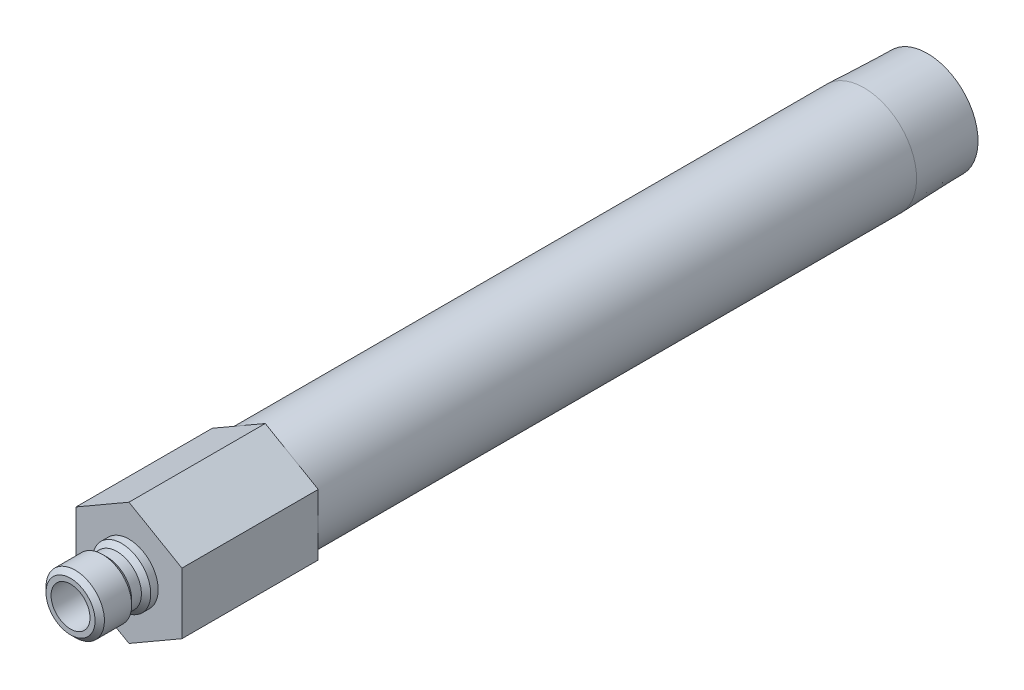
ISO-10303-21;
HEADER;
FILE_DESCRIPTION(('STEP AP214'),'2;1');
FILE_NAME('part.step','',(''),(''),'','','');
FILE_SCHEMA(('AUTOMOTIVE_DESIGN { 1 0 10303 214 1 1 1 1 }'));
ENDSEC;
DATA;
#1=APPLICATION_CONTEXT('core data for automotive mechanical design processes');
#2=APPLICATION_PROTOCOL_DEFINITION('international standard','automotive_design',2000,#1);
#3=PRODUCT_CONTEXT('',#1,'mechanical');
#4=PRODUCT('Part','Part','',(#3));
#5=PRODUCT_RELATED_PRODUCT_CATEGORY('part','',(#4));
#6=PRODUCT_DEFINITION_FORMATION('','',#4);
#7=PRODUCT_DEFINITION_CONTEXT('part definition',#1,'design');
#8=PRODUCT_DEFINITION('design','',#6,#7);
#9=PRODUCT_DEFINITION_SHAPE('','',#8);
#10=(LENGTH_UNIT() NAMED_UNIT(*) SI_UNIT(.MILLI.,.METRE.));
#11=(NAMED_UNIT(*) PLANE_ANGLE_UNIT() SI_UNIT($,.RADIAN.));
#12=(NAMED_UNIT(*) SI_UNIT($,.STERADIAN.) SOLID_ANGLE_UNIT());
#13=UNCERTAINTY_MEASURE_WITH_UNIT(LENGTH_MEASURE(1.E-05),#10,'distance_accuracy_value','');
#14=(GEOMETRIC_REPRESENTATION_CONTEXT(3) GLOBAL_UNCERTAINTY_ASSIGNED_CONTEXT((#13)) GLOBAL_UNIT_ASSIGNED_CONTEXT((#10,
#11,#12)) REPRESENTATION_CONTEXT('',''));
#15=CARTESIAN_POINT('',(0.,0.,0.));
#16=DIRECTION('',(0.,0.,1.));
#17=DIRECTION('',(1.,0.,0.));
#18=AXIS2_PLACEMENT_3D('',#15,#16,#17);
#19=CARTESIAN_POINT('',(0.,0.,0.));
#20=DIRECTION('',(0.,0.,-1.));
#21=DIRECTION('',(0.,1.,0.));
#22=AXIS2_PLACEMENT_3D('',#19,#20,#21);
#23=CYLINDRICAL_SURFACE('',#22,8.57249999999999);
#24=CARTESIAN_POINT('',(0.,0.,-119.8372));
#25=DIRECTION('',(0.,0.,-1.));
#26=DIRECTION('',(0.,1.,0.));
#27=AXIS2_PLACEMENT_3D('',#24,#25,#26);
#28=CIRCLE('',#27,8.57249999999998);
#29=CARTESIAN_POINT('',(0.,8.5725,-119.8372));
#30=VERTEX_POINT('',#29);
#31=EDGE_CURVE('E168',#30,#30,#28,.T.);
#32=ORIENTED_EDGE('',*,*,#31,.F.);
#33=EDGE_LOOP('',(#32));
#34=FACE_BOUND('',#33,.T.);
#35=CARTESIAN_POINT('',(0.,0.,-22.225));
#36=DIRECTION('',(0.,0.,1.));
#37=DIRECTION('',(1.,0.,0.));
#38=AXIS2_PLACEMENT_3D('',#35,#36,#37);
#39=CIRCLE('',#38,8.57249999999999);
#40=CARTESIAN_POINT('',(8.57249999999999,0.,-22.225));
#41=VERTEX_POINT('',#40);
#42=EDGE_CURVE('E37',#41,#41,#39,.F.);
#43=ORIENTED_EDGE('',*,*,#42,.T.);
#44=EDGE_LOOP('',(#43));
#45=FACE_BOUND('',#44,.T.);
#46=ADVANCED_FACE('F33',(#34,#45),#23,.T.);
#47=CARTESIAN_POINT('',(0.,0.,0.));
#48=DIRECTION('',(0.,0.,-1.));
#49=DIRECTION('',(0.,1.,0.));
#50=AXIS2_PLACEMENT_3D('',#47,#48,#49);
#51=CYLINDRICAL_SURFACE('',#50,3.175);
#52=CARTESIAN_POINT('',(0.,0.,9.525));
#53=DIRECTION('',(0.,0.,-1.));
#54=DIRECTION('',(0.,1.,0.));
#55=AXIS2_PLACEMENT_3D('',#52,#53,#54);
#56=CIRCLE('',#55,3.175);
#57=CARTESIAN_POINT('',(0.,3.175,9.525));
#58=VERTEX_POINT('',#57);
#59=EDGE_CURVE('E144',#58,#58,#56,.T.);
#60=ORIENTED_EDGE('',*,*,#59,.F.);
#61=EDGE_LOOP('',(#60));
#62=FACE_BOUND('',#61,.T.);
#63=CARTESIAN_POINT('',(0.,0.,-22.225));
#64=DIRECTION('',(0.,0.,-1.));
#65=DIRECTION('',(0.,1.,0.));
#66=AXIS2_PLACEMENT_3D('',#63,#64,#65);
#67=CIRCLE('',#66,3.17499999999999);
#68=CARTESIAN_POINT('',(0.,3.175,-22.225));
#69=VERTEX_POINT('',#68);
#70=EDGE_CURVE('E11',#69,#69,#67,.T.);
#71=ORIENTED_EDGE('',*,*,#70,.T.);
#72=EDGE_LOOP('',(#71));
#73=FACE_BOUND('',#72,.T.);
#74=ADVANCED_FACE('F35',(#62,#73),#51,.F.);
#75=CARTESIAN_POINT('',(0.,3.175,-22.225));
#76=DIRECTION('',(0.,0.,-1.));
#77=DIRECTION('',(0.,1.,0.));
#78=AXIS2_PLACEMENT_3D('',#75,#76,#77);
#79=PLANE('',#78);
#80=CARTESIAN_POINT('',(0.,0.,-22.225));
#81=DIRECTION('',(0.,0.,-1.));
#82=DIRECTION('',(0.,1.,0.));
#83=AXIS2_PLACEMENT_3D('',#80,#81,#82);
#84=CIRCLE('',#83,6.2611);
#85=CARTESIAN_POINT('',(0.,6.2611,-22.225));
#86=VERTEX_POINT('',#85);
#87=EDGE_CURVE('E43',#86,#86,#84,.T.);
#88=ORIENTED_EDGE('',*,*,#87,.T.);
#89=EDGE_LOOP('',(#88));
#90=FACE_BOUND('',#89,.T.);
#91=ORIENTED_EDGE('',*,*,#70,.F.);
#92=EDGE_LOOP('',(#91));
#93=FACE_BOUND('',#92,.T.);
#94=ADVANCED_FACE('F180',(#90,#93),#79,.T.);
#95=CARTESIAN_POINT('',(0.,0.,0.));
#96=DIRECTION('',(0.,0.,-1.));
#97=DIRECTION('',(0.,1.,0.));
#98=AXIS2_PLACEMENT_3D('',#95,#96,#97);
#99=CYLINDRICAL_SURFACE('',#98,6.26109999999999);
#100=CARTESIAN_POINT('',(0.,0.,-130.175));
#101=DIRECTION('',(0.,0.,-1.));
#102=DIRECTION('',(0.,1.,0.));
#103=AXIS2_PLACEMENT_3D('',#100,#101,#102);
#104=CIRCLE('',#103,6.26109999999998);
#105=CARTESIAN_POINT('',(0.,6.2611,-130.175));
#106=VERTEX_POINT('',#105);
#107=EDGE_CURVE('E174',#106,#106,#104,.T.);
#108=ORIENTED_EDGE('',*,*,#107,.T.);
#109=EDGE_LOOP('',(#108));
#110=FACE_BOUND('',#109,.T.);
#111=ORIENTED_EDGE('',*,*,#87,.F.);
#112=EDGE_LOOP('',(#111));
#113=FACE_BOUND('',#112,.T.);
#114=ADVANCED_FACE('F183',(#110,#113),#99,.F.);
#115=CARTESIAN_POINT('',(0.,8.24944566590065,-130.175));
#116=DIRECTION('',(0.,0.,-1.));
#117=DIRECTION('',(0.,1.,0.));
#118=AXIS2_PLACEMENT_3D('',#115,#116,#117);
#119=PLANE('',#118);
#120=CARTESIAN_POINT('',(0.,0.,-130.175));
#121=DIRECTION('',(0.,0.,-1.));
#122=DIRECTION('',(0.,1.,0.));
#123=AXIS2_PLACEMENT_3D('',#120,#121,#122);
#124=CIRCLE('',#123,8.24944566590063);
#125=CARTESIAN_POINT('',(0.,8.24944566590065,-130.175));
#126=VERTEX_POINT('',#125);
#127=EDGE_CURVE('E171',#126,#126,#124,.T.);
#128=ORIENTED_EDGE('',*,*,#127,.T.);
#129=EDGE_LOOP('',(#128));
#130=FACE_BOUND('',#129,.T.);
#131=ORIENTED_EDGE('',*,*,#107,.F.);
#132=EDGE_LOOP('',(#131));
#133=FACE_BOUND('',#132,.T.);
#134=ADVANCED_FACE('F185',(#130,#133),#119,.T.);
#135=CARTESIAN_POINT('',(0.,0.,-130.175));
#136=DIRECTION('',(0.,0.,1.));
#137=DIRECTION('',(0.,-1.,0.));
#138=AXIS2_PLACEMENT_3D('',#135,#136,#137);
#139=CONICAL_SURFACE('',#138,8.24944566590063,0.0312396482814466);
#140=ORIENTED_EDGE('',*,*,#31,.T.);
#141=EDGE_LOOP('',(#140));
#142=FACE_BOUND('',#141,.T.);
#143=ORIENTED_EDGE('',*,*,#127,.F.);
#144=EDGE_LOOP('',(#143));
#145=FACE_BOUND('',#144,.T.);
#146=ADVANCED_FACE('F192',(#142,#145),#139,.T.);
#147=CARTESIAN_POINT('',(0.,4.7625,0.));
#148=DIRECTION('',(0.,0.,1.));
#149=DIRECTION('',(0.,-1.,0.));
#150=AXIS2_PLACEMENT_3D('',#147,#148,#149);
#151=PLANE('',#150);
#152=CARTESIAN_POINT('',(0.,0.,0.));
#153=DIRECTION('',(0.,0.,-1.));
#154=DIRECTION('',(0.,1.,0.));
#155=AXIS2_PLACEMENT_3D('',#152,#153,#154);
#156=CIRCLE('',#155,4.7625);
#157=CARTESIAN_POINT('',(0.,4.7625,0.));
#158=VERTEX_POINT('',#157);
#159=EDGE_CURVE('E165',#158,#158,#156,.T.);
#160=ORIENTED_EDGE('',*,*,#159,.T.);
#161=EDGE_LOOP('',(#160));
#162=FACE_BOUND('',#161,.T.);
#163=DIRECTION('',(-0.866025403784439,-0.5,0.));
#164=VECTOR('',#163,1.);
#165=CARTESIAN_POINT('',(0.,9.97199384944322,0.));
#166=LINE('',#165,#164);
#167=CARTESIAN_POINT('',(0.,9.97199384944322,0.));
#168=VERTEX_POINT('',#167);
#169=CARTESIAN_POINT('',(-8.636,4.98599692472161,0.));
#170=VERTEX_POINT('',#169);
#171=EDGE_CURVE('E122',#168,#170,#166,.T.);
#172=ORIENTED_EDGE('',*,*,#171,.T.);
#173=DIRECTION('',(0.,-1.,0.));
#174=VECTOR('',#173,1.);
#175=CARTESIAN_POINT('',(-8.636,4.98599692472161,0.));
#176=LINE('',#175,#174);
#177=CARTESIAN_POINT('',(-8.636,-4.98599692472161,0.));
#178=VERTEX_POINT('',#177);
#179=EDGE_CURVE('E125',#170,#178,#176,.T.);
#180=ORIENTED_EDGE('',*,*,#179,.T.);
#181=DIRECTION('',(0.866025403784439,-0.5,0.));
#182=VECTOR('',#181,1.);
#183=CARTESIAN_POINT('',(-8.636,-4.98599692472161,0.));
#184=LINE('',#183,#182);
#185=CARTESIAN_POINT('',(0.,-9.97199384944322,0.));
#186=VERTEX_POINT('',#185);
#187=EDGE_CURVE('E128',#178,#186,#184,.T.);
#188=ORIENTED_EDGE('',*,*,#187,.T.);
#189=DIRECTION('',(0.866025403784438,0.5,0.));
#190=VECTOR('',#189,1.);
#191=CARTESIAN_POINT('',(0.,-9.97199384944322,0.));
#192=LINE('',#191,#190);
#193=CARTESIAN_POINT('',(8.636,-4.98599692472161,0.));
#194=VERTEX_POINT('',#193);
#195=EDGE_CURVE('E131',#186,#194,#192,.T.);
#196=ORIENTED_EDGE('',*,*,#195,.T.);
#197=DIRECTION('',(0.,1.,0.));
#198=VECTOR('',#197,1.);
#199=CARTESIAN_POINT('',(8.636,-4.98599692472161,0.));
#200=LINE('',#199,#198);
#201=CARTESIAN_POINT('',(8.636,4.98599692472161,0.));
#202=VERTEX_POINT('',#201);
#203=EDGE_CURVE('E99',#194,#202,#200,.T.);
#204=ORIENTED_EDGE('',*,*,#203,.T.);
#205=DIRECTION('',(-0.866025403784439,0.5,0.));
#206=VECTOR('',#205,1.);
#207=CARTESIAN_POINT('',(8.636,4.98599692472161,0.));
#208=LINE('',#207,#206);
#209=EDGE_CURVE('E134',#202,#168,#208,.T.);
#210=ORIENTED_EDGE('',*,*,#209,.T.);
#211=EDGE_LOOP('',(#172,#180,#188,#196,#204,#210));
#212=FACE_BOUND('',#211,.T.);
#213=ADVANCED_FACE('F206',(#162,#212),#151,.T.);
#214=CARTESIAN_POINT('',(0.,0.,0.));
#215=DIRECTION('',(0.,0.,-1.));
#216=DIRECTION('',(0.,1.,0.));
#217=AXIS2_PLACEMENT_3D('',#214,#215,#216);
#218=CYLINDRICAL_SURFACE('',#217,4.7625);
#219=CARTESIAN_POINT('',(0.,0.,1.2065));
#220=DIRECTION('',(0.,0.,-1.));
#221=DIRECTION('',(0.,1.,0.));
#222=AXIS2_PLACEMENT_3D('',#219,#220,#221);
#223=CIRCLE('',#222,4.7625);
#224=CARTESIAN_POINT('',(0.,4.7625,1.2065));
#225=VERTEX_POINT('',#224);
#226=EDGE_CURVE('E162',#225,#225,#223,.T.);
#227=ORIENTED_EDGE('',*,*,#226,.T.);
#228=EDGE_LOOP('',(#227));
#229=FACE_BOUND('',#228,.T.);
#230=ORIENTED_EDGE('',*,*,#159,.F.);
#231=EDGE_LOOP('',(#230));
#232=FACE_BOUND('',#231,.T.);
#233=ADVANCED_FACE('F213',(#229,#232),#218,.T.);
#234=CARTESIAN_POINT('',(0.,0.,1.2065));
#235=DIRECTION('',(0.,0.,-1.));
#236=DIRECTION('',(0.,1.,0.));
#237=AXIS2_PLACEMENT_3D('',#234,#235,#236);
#238=CONICAL_SURFACE('',#237,4.7625,0.785398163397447);
#239=CARTESIAN_POINT('',(0.,0.,1.9685));
#240=DIRECTION('',(0.,0.,-1.));
#241=DIRECTION('',(0.,1.,0.));
#242=AXIS2_PLACEMENT_3D('',#239,#240,#241);
#243=CIRCLE('',#242,4.0005);
#244=CARTESIAN_POINT('',(0.,4.0005,1.9685));
#245=VERTEX_POINT('',#244);
#246=EDGE_CURVE('E159',#245,#245,#243,.T.);
#247=ORIENTED_EDGE('',*,*,#246,.T.);
#248=EDGE_LOOP('',(#247));
#249=FACE_BOUND('',#248,.T.);
#250=ORIENTED_EDGE('',*,*,#226,.F.);
#251=EDGE_LOOP('',(#250));
#252=FACE_BOUND('',#251,.T.);
#253=ADVANCED_FACE('F222',(#249,#252),#238,.T.);
#254=CARTESIAN_POINT('',(0.,0.,0.));
#255=DIRECTION('',(0.,0.,-1.));
#256=DIRECTION('',(0.,1.,0.));
#257=AXIS2_PLACEMENT_3D('',#254,#255,#256);
#258=CYLINDRICAL_SURFACE('',#257,4.0005);
#259=CARTESIAN_POINT('',(0.,0.,3.556));
#260=DIRECTION('',(0.,0.,-1.));
#261=DIRECTION('',(0.,1.,0.));
#262=AXIS2_PLACEMENT_3D('',#259,#260,#261);
#263=CIRCLE('',#262,4.0005);
#264=CARTESIAN_POINT('',(0.,4.0005,3.556));
#265=VERTEX_POINT('',#264);
#266=EDGE_CURVE('E156',#265,#265,#263,.T.);
#267=ORIENTED_EDGE('',*,*,#266,.T.);
#268=EDGE_LOOP('',(#267));
#269=FACE_BOUND('',#268,.T.);
#270=ORIENTED_EDGE('',*,*,#246,.F.);
#271=EDGE_LOOP('',(#270));
#272=FACE_BOUND('',#271,.T.);
#273=ADVANCED_FACE('F263',(#269,#272),#258,.T.);
#274=CARTESIAN_POINT('',(0.,0.,3.556));
#275=DIRECTION('',(0.,0.,1.));
#276=DIRECTION('',(0.,-1.,0.));
#277=AXIS2_PLACEMENT_3D('',#274,#275,#276);
#278=CONICAL_SURFACE('',#277,4.0005,0.785398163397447);
#279=CARTESIAN_POINT('',(0.,0.,4.318));
#280=DIRECTION('',(0.,0.,-1.));
#281=DIRECTION('',(0.,1.,0.));
#282=AXIS2_PLACEMENT_3D('',#279,#280,#281);
#283=CIRCLE('',#282,4.7625);
#284=CARTESIAN_POINT('',(0.,4.7625,4.318));
#285=VERTEX_POINT('',#284);
#286=EDGE_CURVE('E153',#285,#285,#283,.T.);
#287=ORIENTED_EDGE('',*,*,#286,.T.);
#288=EDGE_LOOP('',(#287));
#289=FACE_BOUND('',#288,.T.);
#290=ORIENTED_EDGE('',*,*,#266,.F.);
#291=EDGE_LOOP('',(#290));
#292=FACE_BOUND('',#291,.T.);
#293=ADVANCED_FACE('F259',(#289,#292),#278,.T.);
#294=CARTESIAN_POINT('',(0.,0.,0.));
#295=DIRECTION('',(0.,0.,-1.));
#296=DIRECTION('',(0.,1.,0.));
#297=AXIS2_PLACEMENT_3D('',#294,#295,#296);
#298=CYLINDRICAL_SURFACE('',#297,4.7625);
#299=CARTESIAN_POINT('',(0.,0.,8.763));
#300=DIRECTION('',(0.,0.,-1.));
#301=DIRECTION('',(0.,1.,0.));
#302=AXIS2_PLACEMENT_3D('',#299,#300,#301);
#303=CIRCLE('',#302,4.7625);
#304=CARTESIAN_POINT('',(0.,4.7625,8.763));
#305=VERTEX_POINT('',#304);
#306=EDGE_CURVE('E150',#305,#305,#303,.T.);
#307=ORIENTED_EDGE('',*,*,#306,.T.);
#308=EDGE_LOOP('',(#307));
#309=FACE_BOUND('',#308,.T.);
#310=ORIENTED_EDGE('',*,*,#286,.F.);
#311=EDGE_LOOP('',(#310));
#312=FACE_BOUND('',#311,.T.);
#313=ADVANCED_FACE('F255',(#309,#312),#298,.T.);
#314=CARTESIAN_POINT('',(0.,0.,8.763));
#315=DIRECTION('',(0.,0.,-1.));
#316=DIRECTION('',(0.,1.,0.));
#317=AXIS2_PLACEMENT_3D('',#314,#315,#316);
#318=CONICAL_SURFACE('',#317,4.7625,0.785398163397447);
#319=CARTESIAN_POINT('',(0.,0.,9.525));
#320=DIRECTION('',(0.,0.,-1.));
#321=DIRECTION('',(0.,1.,0.));
#322=AXIS2_PLACEMENT_3D('',#319,#320,#321);
#323=CIRCLE('',#322,4.0005);
#324=CARTESIAN_POINT('',(0.,4.0005,9.525));
#325=VERTEX_POINT('',#324);
#326=EDGE_CURVE('E147',#325,#325,#323,.T.);
#327=ORIENTED_EDGE('',*,*,#326,.T.);
#328=EDGE_LOOP('',(#327));
#329=FACE_BOUND('',#328,.T.);
#330=ORIENTED_EDGE('',*,*,#306,.F.);
#331=EDGE_LOOP('',(#330));
#332=FACE_BOUND('',#331,.T.);
#333=ADVANCED_FACE('F251',(#329,#332),#318,.T.);
#334=CARTESIAN_POINT('',(0.,3.175,9.525));
#335=DIRECTION('',(0.,0.,1.));
#336=DIRECTION('',(0.,-1.,0.));
#337=AXIS2_PLACEMENT_3D('',#334,#335,#336);
#338=PLANE('',#337);
#339=ORIENTED_EDGE('',*,*,#59,.T.);
#340=EDGE_LOOP('',(#339));
#341=FACE_BOUND('',#340,.T.);
#342=ORIENTED_EDGE('',*,*,#326,.F.);
#343=EDGE_LOOP('',(#342));
#344=FACE_BOUND('',#343,.T.);
#345=ADVANCED_FACE('F239',(#341,#344),#338,.T.);
#346=CARTESIAN_POINT('',(0.,9.97199384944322,-22.225));
#347=DIRECTION('',(-0.5,0.866025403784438,0.));
#348=DIRECTION('',(-0.866025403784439,-0.5,0.));
#349=AXIS2_PLACEMENT_3D('',#346,#347,#348);
#350=PLANE('',#349);
#351=ORIENTED_EDGE('',*,*,#171,.F.);
#352=DIRECTION('',(0.,0.,1.));
#353=VECTOR('',#352,1.);
#354=CARTESIAN_POINT('',(0.,9.97199384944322,-22.225));
#355=LINE('',#354,#353);
#356=CARTESIAN_POINT('',(0.,9.97199384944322,-22.225));
#357=VERTEX_POINT('',#356);
#358=EDGE_CURVE('E51',#357,#168,#355,.T.);
#359=ORIENTED_EDGE('',*,*,#358,.F.);
#360=DIRECTION('',(-0.866025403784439,-0.5,0.));
#361=VECTOR('',#360,1.);
#362=CARTESIAN_POINT('',(0.,9.97199384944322,-22.225));
#363=LINE('',#362,#361);
#364=CARTESIAN_POINT('',(-8.636,4.98599692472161,-22.225));
#365=VERTEX_POINT('',#364);
#366=EDGE_CURVE('E137',#357,#365,#363,.T.);
#367=ORIENTED_EDGE('',*,*,#366,.T.);
#368=DIRECTION('',(0.,0.,1.));
#369=VECTOR('',#368,1.);
#370=CARTESIAN_POINT('',(-8.636,4.98599692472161,-22.225));
#371=LINE('',#370,#369);
#372=EDGE_CURVE('E86',#365,#170,#371,.T.);
#373=ORIENTED_EDGE('',*,*,#372,.T.);
#374=EDGE_LOOP('',(#351,#359,#367,#373));
#375=FACE_BOUND('',#374,.T.);
#376=ADVANCED_FACE('F226',(#375),#350,.T.);
#377=CARTESIAN_POINT('',(8.636,4.98599692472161,-22.225));
#378=DIRECTION('',(0.5,0.866025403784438,0.));
#379=DIRECTION('',(-0.866025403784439,0.5,0.));
#380=AXIS2_PLACEMENT_3D('',#377,#378,#379);
#381=PLANE('',#380);
#382=ORIENTED_EDGE('',*,*,#209,.F.);
#383=DIRECTION('',(0.,0.,1.));
#384=VECTOR('',#383,1.);
#385=CARTESIAN_POINT('',(8.636,4.98599692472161,-22.225));
#386=LINE('',#385,#384);
#387=CARTESIAN_POINT('',(8.636,4.98599692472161,-22.225));
#388=VERTEX_POINT('',#387);
#389=EDGE_CURVE('E74',#388,#202,#386,.T.);
#390=ORIENTED_EDGE('',*,*,#389,.F.);
#391=DIRECTION('',(-0.866025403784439,0.5,0.));
#392=VECTOR('',#391,1.);
#393=CARTESIAN_POINT('',(8.636,4.98599692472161,-22.225));
#394=LINE('',#393,#392);
#395=EDGE_CURVE('E112',#388,#357,#394,.T.);
#396=ORIENTED_EDGE('',*,*,#395,.T.);
#397=ORIENTED_EDGE('',*,*,#358,.T.);
#398=EDGE_LOOP('',(#382,#390,#396,#397));
#399=FACE_BOUND('',#398,.T.);
#400=ADVANCED_FACE('F231',(#399),#381,.T.);
#401=CARTESIAN_POINT('',(8.636,-4.98599692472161,-22.225));
#402=DIRECTION('',(1.,0.,0.));
#403=DIRECTION('',(0.,1.,0.));
#404=AXIS2_PLACEMENT_3D('',#401,#402,#403);
#405=PLANE('',#404);
#406=ORIENTED_EDGE('',*,*,#203,.F.);
#407=DIRECTION('',(0.,0.,1.));
#408=VECTOR('',#407,1.);
#409=CARTESIAN_POINT('',(8.636,-4.98599692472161,-22.225));
#410=LINE('',#409,#408);
#411=CARTESIAN_POINT('',(8.636,-4.98599692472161,-22.225));
#412=VERTEX_POINT('',#411);
#413=EDGE_CURVE('E94',#412,#194,#410,.T.);
#414=ORIENTED_EDGE('',*,*,#413,.F.);
#415=DIRECTION('',(0.,1.,0.));
#416=VECTOR('',#415,1.);
#417=CARTESIAN_POINT('',(8.636,-4.98599692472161,-22.225));
#418=LINE('',#417,#416);
#419=EDGE_CURVE('E97',#412,#388,#418,.T.);
#420=ORIENTED_EDGE('',*,*,#419,.T.);
#421=ORIENTED_EDGE('',*,*,#389,.T.);
#422=EDGE_LOOP('',(#406,#414,#420,#421));
#423=FACE_BOUND('',#422,.T.);
#424=ADVANCED_FACE('F96',(#423),#405,.T.);
#425=CARTESIAN_POINT('',(0.,-9.97199384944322,-22.225));
#426=DIRECTION('',(0.5,-0.866025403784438,0.));
#427=DIRECTION('',(0.866025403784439,0.5,0.));
#428=AXIS2_PLACEMENT_3D('',#425,#426,#427);
#429=PLANE('',#428);
#430=ORIENTED_EDGE('',*,*,#195,.F.);
#431=DIRECTION('',(0.,0.,1.));
#432=VECTOR('',#431,1.);
#433=CARTESIAN_POINT('',(0.,-9.97199384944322,-22.225));
#434=LINE('',#433,#432);
#435=CARTESIAN_POINT('',(0.,-9.97199384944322,-22.225));
#436=VERTEX_POINT('',#435);
#437=EDGE_CURVE('E104',#436,#186,#434,.T.);
#438=ORIENTED_EDGE('',*,*,#437,.F.);
#439=DIRECTION('',(0.866025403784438,0.5,0.));
#440=VECTOR('',#439,1.);
#441=CARTESIAN_POINT('',(0.,-9.97199384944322,-22.225));
#442=LINE('',#441,#440);
#443=EDGE_CURVE('E110',#436,#412,#442,.T.);
#444=ORIENTED_EDGE('',*,*,#443,.T.);
#445=ORIENTED_EDGE('',*,*,#413,.T.);
#446=EDGE_LOOP('',(#430,#438,#444,#445));
#447=FACE_BOUND('',#446,.T.);
#448=ADVANCED_FACE('F114',(#447),#429,.T.);
#449=CARTESIAN_POINT('',(-8.636,-4.98599692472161,-22.225));
#450=DIRECTION('',(-0.5,-0.866025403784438,0.));
#451=DIRECTION('',(0.866025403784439,-0.5,0.));
#452=AXIS2_PLACEMENT_3D('',#449,#450,#451);
#453=PLANE('',#452);
#454=ORIENTED_EDGE('',*,*,#187,.F.);
#455=DIRECTION('',(0.,0.,1.));
#456=VECTOR('',#455,1.);
#457=CARTESIAN_POINT('',(-8.636,-4.98599692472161,-22.225));
#458=LINE('',#457,#456);
#459=CARTESIAN_POINT('',(-8.636,-4.98599692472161,-22.225));
#460=VERTEX_POINT('',#459);
#461=EDGE_CURVE('E141',#460,#178,#458,.T.);
#462=ORIENTED_EDGE('',*,*,#461,.F.);
#463=DIRECTION('',(0.866025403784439,-0.5,0.));
#464=VECTOR('',#463,1.);
#465=CARTESIAN_POINT('',(-8.636,-4.98599692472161,-22.225));
#466=LINE('',#465,#464);
#467=EDGE_CURVE('E115',#460,#436,#466,.T.);
#468=ORIENTED_EDGE('',*,*,#467,.T.);
#469=ORIENTED_EDGE('',*,*,#437,.T.);
#470=EDGE_LOOP('',(#454,#462,#468,#469));
#471=FACE_BOUND('',#470,.T.);
#472=ADVANCED_FACE('F230',(#471),#453,.T.);
#473=CARTESIAN_POINT('',(-8.636,4.98599692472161,-22.225));
#474=DIRECTION('',(-1.,0.,0.));
#475=DIRECTION('',(0.,0.,1.));
#476=AXIS2_PLACEMENT_3D('',#473,#474,#475);
#477=PLANE('',#476);
#478=ORIENTED_EDGE('',*,*,#179,.F.);
#479=ORIENTED_EDGE('',*,*,#372,.F.);
#480=DIRECTION('',(0.,-1.,0.));
#481=VECTOR('',#480,1.);
#482=CARTESIAN_POINT('',(-8.636,4.98599692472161,-22.225));
#483=LINE('',#482,#481);
#484=EDGE_CURVE('E117',#365,#460,#483,.T.);
#485=ORIENTED_EDGE('',*,*,#484,.T.);
#486=ORIENTED_EDGE('',*,*,#461,.T.);
#487=EDGE_LOOP('',(#478,#479,#485,#486));
#488=FACE_BOUND('',#487,.T.);
#489=ADVANCED_FACE('F227',(#488),#477,.T.);
#490=CARTESIAN_POINT('',(-8.636,4.98599692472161,-22.225));
#491=DIRECTION('',(0.,0.,1.));
#492=DIRECTION('',(1.,0.,0.));
#493=AXIS2_PLACEMENT_3D('',#490,#491,#492);
#494=PLANE('',#493);
#495=ORIENTED_EDGE('',*,*,#42,.F.);
#496=EDGE_LOOP('',(#495));
#497=FACE_BOUND('',#496,.T.);
#498=ORIENTED_EDGE('',*,*,#366,.F.);
#499=ORIENTED_EDGE('',*,*,#395,.F.);
#500=ORIENTED_EDGE('',*,*,#419,.F.);
#501=ORIENTED_EDGE('',*,*,#443,.F.);
#502=ORIENTED_EDGE('',*,*,#467,.F.);
#503=ORIENTED_EDGE('',*,*,#484,.F.);
#504=EDGE_LOOP('',(#498,#499,#500,#501,#502,#503));
#505=FACE_BOUND('',#504,.T.);
#506=ADVANCED_FACE('F108',(#497,#505),#494,.F.);
#507=CLOSED_SHELL('',(#46,#74,#94,#114,#134,#146,#213,#233,#253,#273,#293,#313,#333,#345,#376,
#400,#424,#448,#472,#489,#506));
#508=MANIFOLD_SOLID_BREP('B2',#507);
#509=ADVANCED_BREP_SHAPE_REPRESENTATION('',(#18,#508),#14);
#510=SHAPE_DEFINITION_REPRESENTATION(#9,#509);
ENDSEC;
END-ISO-10303-21;
